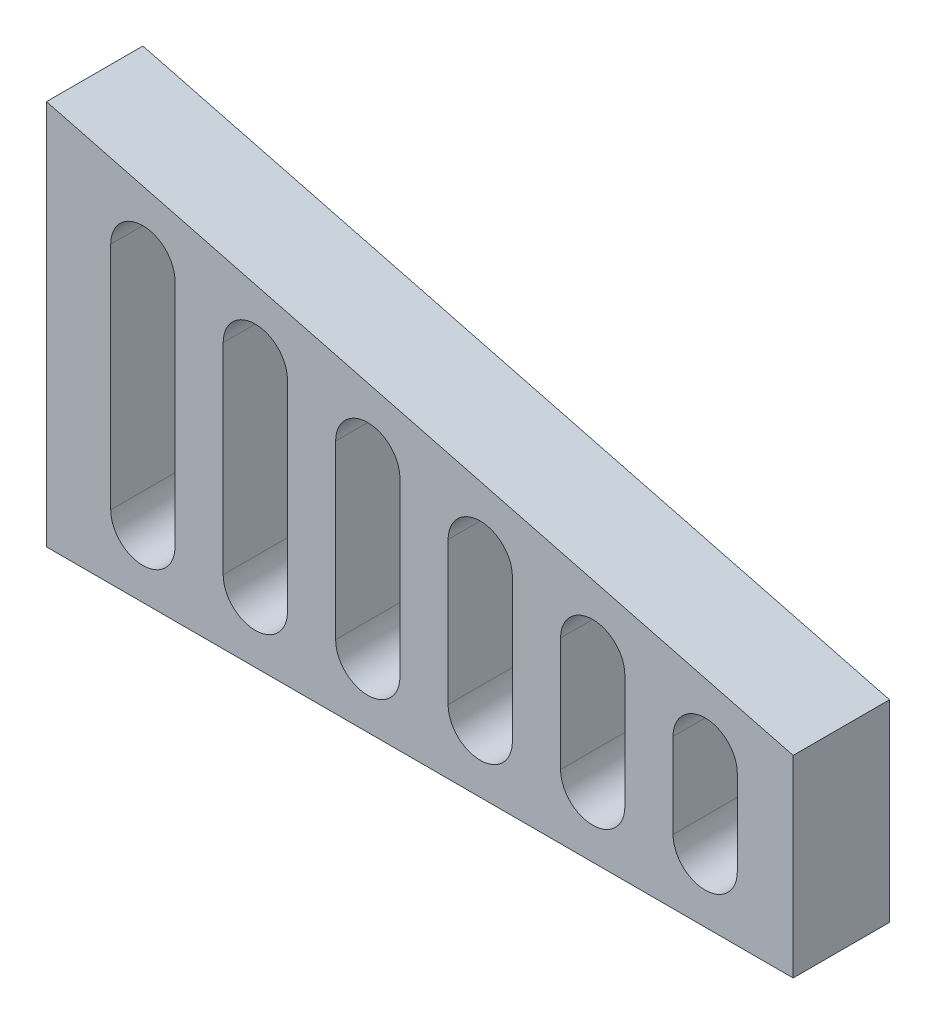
ISO-10303-21;
HEADER;
FILE_DESCRIPTION(('STEP AP214'),'2;1');
FILE_NAME('part.step','',(''),(''),'','','');
FILE_SCHEMA(('AUTOMOTIVE_DESIGN { 1 0 10303 214 1 1 1 1 }'));
ENDSEC;
DATA;
#1=APPLICATION_CONTEXT('core data for automotive mechanical design processes');
#2=APPLICATION_PROTOCOL_DEFINITION('international standard','automotive_design',2000,#1);
#3=PRODUCT_CONTEXT('',#1,'mechanical');
#4=PRODUCT('Part','Part','',(#3));
#5=PRODUCT_RELATED_PRODUCT_CATEGORY('part','',(#4));
#6=PRODUCT_DEFINITION_FORMATION('','',#4);
#7=PRODUCT_DEFINITION_CONTEXT('part definition',#1,'design');
#8=PRODUCT_DEFINITION('design','',#6,#7);
#9=PRODUCT_DEFINITION_SHAPE('','',#8);
#10=(LENGTH_UNIT() NAMED_UNIT(*) SI_UNIT(.MILLI.,.METRE.));
#11=(NAMED_UNIT(*) PLANE_ANGLE_UNIT() SI_UNIT($,.RADIAN.));
#12=(NAMED_UNIT(*) SI_UNIT($,.STERADIAN.) SOLID_ANGLE_UNIT());
#13=UNCERTAINTY_MEASURE_WITH_UNIT(LENGTH_MEASURE(1.E-05),#10,'distance_accuracy_value','');
#14=(GEOMETRIC_REPRESENTATION_CONTEXT(3) GLOBAL_UNCERTAINTY_ASSIGNED_CONTEXT((#13)) GLOBAL_UNIT_ASSIGNED_CONTEXT((#10,
#11,#12)) REPRESENTATION_CONTEXT('',''));
#15=CARTESIAN_POINT('',(0.,0.,0.));
#16=DIRECTION('',(0.,0.,1.));
#17=DIRECTION('',(1.,0.,0.));
#18=AXIS2_PLACEMENT_3D('',#15,#16,#17);
#19=CARTESIAN_POINT('',(0.,38.1,-9.525));
#20=DIRECTION('',(1.,0.,0.));
#21=DIRECTION('',(0.,0.,-1.));
#22=AXIS2_PLACEMENT_3D('',#19,#20,#21);
#23=PLANE('',#22);
#24=DIRECTION('',(0.,1.,0.));
#25=VECTOR('',#24,1.);
#26=CARTESIAN_POINT('',(0.,38.1,0.));
#27=LINE('',#26,#25);
#28=CARTESIAN_POINT('',(0.,0.,0.));
#29=VERTEX_POINT('',#28);
#30=CARTESIAN_POINT('',(0.,38.1,0.));
#31=VERTEX_POINT('',#30);
#32=EDGE_CURVE('E402',#29,#31,#27,.T.);
#33=ORIENTED_EDGE('',*,*,#32,.T.);
#34=DIRECTION('',(0.,0.,1.));
#35=VECTOR('',#34,1.);
#36=CARTESIAN_POINT('',(0.,38.1,-9.525));
#37=LINE('',#36,#35);
#38=CARTESIAN_POINT('',(0.,38.1,-9.525));
#39=VERTEX_POINT('',#38);
#40=EDGE_CURVE('E11',#39,#31,#37,.T.);
#41=ORIENTED_EDGE('',*,*,#40,.F.);
#42=DIRECTION('',(0.,1.,0.));
#43=VECTOR('',#42,1.);
#44=CARTESIAN_POINT('',(0.,38.1,-9.525));
#45=LINE('',#44,#43);
#46=CARTESIAN_POINT('',(0.,0.,-9.525));
#47=VERTEX_POINT('',#46);
#48=EDGE_CURVE('E417',#47,#39,#45,.T.);
#49=ORIENTED_EDGE('',*,*,#48,.F.);
#50=DIRECTION('',(0.,0.,1.));
#51=VECTOR('',#50,1.);
#52=CARTESIAN_POINT('',(0.,0.,-9.525));
#53=LINE('',#52,#51);
#54=EDGE_CURVE('E426',#47,#29,#53,.T.);
#55=ORIENTED_EDGE('',*,*,#54,.T.);
#56=EDGE_LOOP('',(#33,#41,#49,#55));
#57=FACE_BOUND('',#56,.T.);
#58=ADVANCED_FACE('F28',(#57),#23,.F.);
#59=CARTESIAN_POINT('',(0.,38.1,-9.525));
#60=DIRECTION('',(-0.25,-0.968245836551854,0.));
#61=DIRECTION('',(0.968245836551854,-0.25,0.));
#62=AXIS2_PLACEMENT_3D('',#59,#60,#61);
#63=PLANE('',#62);
#64=DIRECTION('',(0.968245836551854,-0.25,0.));
#65=VECTOR('',#64,1.);
#66=CARTESIAN_POINT('',(0.,38.1,0.));
#67=LINE('',#66,#65);
#68=CARTESIAN_POINT('',(73.7803327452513,19.05,0.));
#69=VERTEX_POINT('',#68);
#70=EDGE_CURVE('E411',#31,#69,#67,.T.);
#71=ORIENTED_EDGE('',*,*,#70,.T.);
#72=DIRECTION('',(0.,0.,1.));
#73=VECTOR('',#72,1.);
#74=CARTESIAN_POINT('',(73.7803327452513,19.05,-9.525));
#75=LINE('',#74,#73);
#76=CARTESIAN_POINT('',(73.7803327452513,19.05,-9.525));
#77=VERTEX_POINT('',#76);
#78=EDGE_CURVE('E35',#77,#69,#75,.T.);
#79=ORIENTED_EDGE('',*,*,#78,.F.);
#80=DIRECTION('',(0.968245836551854,-0.25,0.));
#81=VECTOR('',#80,1.);
#82=CARTESIAN_POINT('',(0.,38.1,-9.525));
#83=LINE('',#82,#81);
#84=EDGE_CURVE('E420',#39,#77,#83,.T.);
#85=ORIENTED_EDGE('',*,*,#84,.F.);
#86=ORIENTED_EDGE('',*,*,#40,.T.);
#87=EDGE_LOOP('',(#71,#79,#85,#86));
#88=FACE_BOUND('',#87,.T.);
#89=ADVANCED_FACE('F451',(#88),#63,.F.);
#90=CARTESIAN_POINT('',(73.7803327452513,19.05,-9.525));
#91=DIRECTION('',(-1.,0.,0.));
#92=DIRECTION('',(0.,0.,1.));
#93=AXIS2_PLACEMENT_3D('',#90,#91,#92);
#94=PLANE('',#93);
#95=DIRECTION('',(0.,-1.,0.));
#96=VECTOR('',#95,1.);
#97=CARTESIAN_POINT('',(73.7803327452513,19.05,0.));
#98=LINE('',#97,#96);
#99=CARTESIAN_POINT('',(73.7803327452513,0.,0.));
#100=VERTEX_POINT('',#99);
#101=EDGE_CURVE('E413',#69,#100,#98,.T.);
#102=ORIENTED_EDGE('',*,*,#101,.T.);
#103=DIRECTION('',(0.,0.,1.));
#104=VECTOR('',#103,1.);
#105=CARTESIAN_POINT('',(73.7803327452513,0.,-9.525));
#106=LINE('',#105,#104);
#107=CARTESIAN_POINT('',(73.7803327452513,0.,-9.525));
#108=VERTEX_POINT('',#107);
#109=EDGE_CURVE('E429',#108,#100,#106,.T.);
#110=ORIENTED_EDGE('',*,*,#109,.F.);
#111=DIRECTION('',(0.,-1.,0.));
#112=VECTOR('',#111,1.);
#113=CARTESIAN_POINT('',(73.7803327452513,19.05,-9.525));
#114=LINE('',#113,#112);
#115=EDGE_CURVE('E422',#77,#108,#114,.T.);
#116=ORIENTED_EDGE('',*,*,#115,.F.);
#117=ORIENTED_EDGE('',*,*,#78,.T.);
#118=EDGE_LOOP('',(#102,#110,#116,#117));
#119=FACE_BOUND('',#118,.T.);
#120=ADVANCED_FACE('F436',(#119),#94,.F.);
#121=CARTESIAN_POINT('',(0.,0.,-9.525));
#122=DIRECTION('',(0.,1.,0.));
#123=DIRECTION('',(0.,0.,1.));
#124=AXIS2_PLACEMENT_3D('',#121,#122,#123);
#125=PLANE('',#124);
#126=DIRECTION('',(-1.,0.,0.));
#127=VECTOR('',#126,1.);
#128=CARTESIAN_POINT('',(0.,0.,0.));
#129=LINE('',#128,#127);
#130=EDGE_CURVE('E415',#100,#29,#129,.T.);
#131=ORIENTED_EDGE('',*,*,#130,.T.);
#132=ORIENTED_EDGE('',*,*,#54,.F.);
#133=DIRECTION('',(-1.,0.,0.));
#134=VECTOR('',#133,1.);
#135=CARTESIAN_POINT('',(0.,0.,-9.525));
#136=LINE('',#135,#134);
#137=EDGE_CURVE('E424',#108,#47,#136,.T.);
#138=ORIENTED_EDGE('',*,*,#137,.F.);
#139=ORIENTED_EDGE('',*,*,#109,.T.);
#140=EDGE_LOOP('',(#131,#132,#138,#139));
#141=FACE_BOUND('',#140,.T.);
#142=ADVANCED_FACE('F445',(#141),#125,.F.);
#143=CARTESIAN_POINT('',(0.,0.,-9.525));
#144=DIRECTION('',(0.,0.,1.));
#145=DIRECTION('',(1.,0.,0.));
#146=AXIS2_PLACEMENT_3D('',#143,#144,#145);
#147=PLANE('',#146);
#148=DIRECTION('',(0.,1.,0.));
#149=VECTOR('',#148,1.);
#150=CARTESIAN_POINT('',(61.9125,6.35,-9.525));
#151=LINE('',#150,#149);
#152=CARTESIAN_POINT('',(61.9125,6.35,-9.525));
#153=VERTEX_POINT('',#152);
#154=CARTESIAN_POINT('',(61.9125,14.7362279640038,-9.525));
#155=VERTEX_POINT('',#154);
#156=EDGE_CURVE('E223',#153,#155,#151,.T.);
#157=ORIENTED_EDGE('',*,*,#156,.F.);
#158=CARTESIAN_POINT('',(65.0875,6.35,-9.525));
#159=DIRECTION('',(0.,0.,-1.));
#160=DIRECTION('',(0.,-1.,0.));
#161=AXIS2_PLACEMENT_3D('',#158,#159,#160);
#162=CIRCLE('',#161,3.175);
#163=CARTESIAN_POINT('',(68.2625,6.35,-9.525));
#164=VERTEX_POINT('',#163);
#165=EDGE_CURVE('E42',#164,#153,#162,.T.);
#166=ORIENTED_EDGE('',*,*,#165,.F.);
#167=DIRECTION('',(0.,-1.,0.));
#168=VECTOR('',#167,1.);
#169=CARTESIAN_POINT('',(68.2625,6.35,-9.525));
#170=LINE('',#169,#168);
#171=CARTESIAN_POINT('',(68.2625,14.7362279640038,-9.525));
#172=VERTEX_POINT('',#171);
#173=EDGE_CURVE('E230',#172,#164,#170,.T.);
#174=ORIENTED_EDGE('',*,*,#173,.F.);
#175=CARTESIAN_POINT('',(65.0875,14.7362279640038,-9.525));
#176=DIRECTION('',(0.,0.,-1.));
#177=DIRECTION('',(0.,-1.,0.));
#178=AXIS2_PLACEMENT_3D('',#175,#176,#177);
#179=CIRCLE('',#178,3.175);
#180=EDGE_CURVE('E214',#155,#172,#179,.T.);
#181=ORIENTED_EDGE('',*,*,#180,.F.);
#182=EDGE_LOOP('',(#157,#166,#174,#181));
#183=FACE_BOUND('',#182,.T.);
#184=DIRECTION('',(0.,1.,0.));
#185=VECTOR('',#184,1.);
#186=CARTESIAN_POINT('',(50.8,6.35,-9.525));
#187=LINE('',#186,#185);
#188=CARTESIAN_POINT('',(50.8,6.35,-9.525));
#189=VERTEX_POINT('',#188);
#190=CARTESIAN_POINT('',(50.8,17.6054631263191,-9.525));
#191=VERTEX_POINT('',#190);
#192=EDGE_CURVE('E250',#189,#191,#187,.T.);
#193=ORIENTED_EDGE('',*,*,#192,.F.);
#194=CARTESIAN_POINT('',(53.975,6.35,-9.525));
#195=DIRECTION('',(0.,0.,-1.));
#196=DIRECTION('',(0.,-1.,0.));
#197=AXIS2_PLACEMENT_3D('',#194,#195,#196);
#198=CIRCLE('',#197,3.175);
#199=CARTESIAN_POINT('',(57.15,6.35,-9.525));
#200=VERTEX_POINT('',#199);
#201=EDGE_CURVE('E246',#200,#189,#198,.T.);
#202=ORIENTED_EDGE('',*,*,#201,.F.);
#203=DIRECTION('',(0.,-1.,0.));
#204=VECTOR('',#203,1.);
#205=CARTESIAN_POINT('',(57.15,6.35,-9.525));
#206=LINE('',#205,#204);
#207=CARTESIAN_POINT('',(57.15,17.6054631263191,-9.525));
#208=VERTEX_POINT('',#207);
#209=EDGE_CURVE('E256',#208,#200,#206,.T.);
#210=ORIENTED_EDGE('',*,*,#209,.F.);
#211=CARTESIAN_POINT('',(53.975,17.6054631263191,-9.525));
#212=DIRECTION('',(0.,0.,-1.));
#213=DIRECTION('',(0.,-1.,0.));
#214=AXIS2_PLACEMENT_3D('',#211,#212,#213);
#215=CIRCLE('',#214,3.175);
#216=EDGE_CURVE('E253',#191,#208,#215,.T.);
#217=ORIENTED_EDGE('',*,*,#216,.F.);
#218=EDGE_LOOP('',(#193,#202,#210,#217));
#219=FACE_BOUND('',#218,.T.);
#220=DIRECTION('',(0.,1.,0.));
#221=VECTOR('',#220,1.);
#222=CARTESIAN_POINT('',(39.6875,6.35,-9.525));
#223=LINE('',#222,#221);
#224=CARTESIAN_POINT('',(39.6875,6.35,-9.525));
#225=VERTEX_POINT('',#224);
#226=CARTESIAN_POINT('',(39.6875,20.4746982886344,-9.525));
#227=VERTEX_POINT('',#226);
#228=EDGE_CURVE('E282',#225,#227,#223,.T.);
#229=ORIENTED_EDGE('',*,*,#228,.F.);
#230=CARTESIAN_POINT('',(42.8625,6.35,-9.525));
#231=DIRECTION('',(0.,0.,-1.));
#232=DIRECTION('',(0.,-1.,0.));
#233=AXIS2_PLACEMENT_3D('',#230,#231,#232);
#234=CIRCLE('',#233,3.175);
#235=CARTESIAN_POINT('',(46.0375,6.35,-9.525));
#236=VERTEX_POINT('',#235);
#237=EDGE_CURVE('E274',#236,#225,#234,.T.);
#238=ORIENTED_EDGE('',*,*,#237,.F.);
#239=DIRECTION('',(0.,-1.,0.));
#240=VECTOR('',#239,1.);
#241=CARTESIAN_POINT('',(46.0375,6.35,-9.525));
#242=LINE('',#241,#240);
#243=CARTESIAN_POINT('',(46.0375,20.4746982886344,-9.525));
#244=VERTEX_POINT('',#243);
#245=EDGE_CURVE('E288',#244,#236,#242,.T.);
#246=ORIENTED_EDGE('',*,*,#245,.F.);
#247=CARTESIAN_POINT('',(42.8625,20.4746982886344,-9.525));
#248=DIRECTION('',(0.,0.,-1.));
#249=DIRECTION('',(0.,-1.,0.));
#250=AXIS2_PLACEMENT_3D('',#247,#248,#249);
#251=CIRCLE('',#250,3.175);
#252=EDGE_CURVE('E285',#227,#244,#251,.T.);
#253=ORIENTED_EDGE('',*,*,#252,.F.);
#254=EDGE_LOOP('',(#229,#238,#246,#253));
#255=FACE_BOUND('',#254,.T.);
#256=DIRECTION('',(0.,1.,0.));
#257=VECTOR('',#256,1.);
#258=CARTESIAN_POINT('',(28.575,6.35,-9.525));
#259=LINE('',#258,#257);
#260=CARTESIAN_POINT('',(28.575,6.35,-9.525));
#261=VERTEX_POINT('',#260);
#262=CARTESIAN_POINT('',(28.575,23.3439334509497,-9.525));
#263=VERTEX_POINT('',#262);
#264=EDGE_CURVE('E314',#261,#263,#259,.T.);
#265=ORIENTED_EDGE('',*,*,#264,.F.);
#266=CARTESIAN_POINT('',(31.75,6.35,-9.525));
#267=DIRECTION('',(0.,0.,-1.));
#268=DIRECTION('',(0.,-1.,0.));
#269=AXIS2_PLACEMENT_3D('',#266,#267,#268);
#270=CIRCLE('',#269,3.175);
#271=CARTESIAN_POINT('',(34.925,6.35,-9.525));
#272=VERTEX_POINT('',#271);
#273=EDGE_CURVE('E306',#272,#261,#270,.T.);
#274=ORIENTED_EDGE('',*,*,#273,.F.);
#275=DIRECTION('',(0.,-1.,0.));
#276=VECTOR('',#275,1.);
#277=CARTESIAN_POINT('',(34.925,6.35,-9.525));
#278=LINE('',#277,#276);
#279=CARTESIAN_POINT('',(34.925,23.3439334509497,-9.525));
#280=VERTEX_POINT('',#279);
#281=EDGE_CURVE('E320',#280,#272,#278,.T.);
#282=ORIENTED_EDGE('',*,*,#281,.F.);
#283=CARTESIAN_POINT('',(31.75,23.3439334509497,-9.525));
#284=DIRECTION('',(0.,0.,-1.));
#285=DIRECTION('',(0.,-1.,0.));
#286=AXIS2_PLACEMENT_3D('',#283,#284,#285);
#287=CIRCLE('',#286,3.175);
#288=EDGE_CURVE('E317',#263,#280,#287,.T.);
#289=ORIENTED_EDGE('',*,*,#288,.F.);
#290=EDGE_LOOP('',(#265,#274,#282,#289));
#291=FACE_BOUND('',#290,.T.);
#292=DIRECTION('',(0.,1.,0.));
#293=VECTOR('',#292,1.);
#294=CARTESIAN_POINT('',(17.4625,6.35,-9.525));
#295=LINE('',#294,#293);
#296=CARTESIAN_POINT('',(17.4625,6.34999999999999,-9.525));
#297=VERTEX_POINT('',#296);
#298=CARTESIAN_POINT('',(17.4625,26.2131686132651,-9.525));
#299=VERTEX_POINT('',#298);
#300=EDGE_CURVE('E346',#297,#299,#295,.T.);
#301=ORIENTED_EDGE('',*,*,#300,.F.);
#302=CARTESIAN_POINT('',(20.6375,6.35,-9.525));
#303=DIRECTION('',(0.,0.,-1.));
#304=DIRECTION('',(0.,-1.,0.));
#305=AXIS2_PLACEMENT_3D('',#302,#303,#304);
#306=CIRCLE('',#305,3.175);
#307=CARTESIAN_POINT('',(23.8125,6.35,-9.525));
#308=VERTEX_POINT('',#307);
#309=EDGE_CURVE('E338',#308,#297,#306,.T.);
#310=ORIENTED_EDGE('',*,*,#309,.F.);
#311=DIRECTION('',(0.,-1.,0.));
#312=VECTOR('',#311,1.);
#313=CARTESIAN_POINT('',(23.8125,6.35,-9.525));
#314=LINE('',#313,#312);
#315=CARTESIAN_POINT('',(23.8125,26.2131686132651,-9.525));
#316=VERTEX_POINT('',#315);
#317=EDGE_CURVE('E352',#316,#308,#314,.T.);
#318=ORIENTED_EDGE('',*,*,#317,.F.);
#319=CARTESIAN_POINT('',(20.6375,26.2131686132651,-9.525));
#320=DIRECTION('',(0.,0.,-1.));
#321=DIRECTION('',(0.,-1.,0.));
#322=AXIS2_PLACEMENT_3D('',#319,#320,#321);
#323=CIRCLE('',#322,3.175);
#324=EDGE_CURVE('E349',#299,#316,#323,.T.);
#325=ORIENTED_EDGE('',*,*,#324,.F.);
#326=EDGE_LOOP('',(#301,#310,#318,#325));
#327=FACE_BOUND('',#326,.T.);
#328=DIRECTION('',(0.,1.,0.));
#329=VECTOR('',#328,1.);
#330=CARTESIAN_POINT('',(6.35,6.34999999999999,-9.525));
#331=LINE('',#330,#329);
#332=CARTESIAN_POINT('',(6.35,6.34999999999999,-9.525));
#333=VERTEX_POINT('',#332);
#334=CARTESIAN_POINT('',(6.35,29.0824037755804,-9.525));
#335=VERTEX_POINT('',#334);
#336=EDGE_CURVE('E378',#333,#335,#331,.T.);
#337=ORIENTED_EDGE('',*,*,#336,.F.);
#338=CARTESIAN_POINT('',(9.525,6.35,-9.525));
#339=DIRECTION('',(0.,0.,-1.));
#340=DIRECTION('',(0.,-1.,0.));
#341=AXIS2_PLACEMENT_3D('',#338,#339,#340);
#342=CIRCLE('',#341,3.175);
#343=CARTESIAN_POINT('',(12.7,6.34999999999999,-9.525));
#344=VERTEX_POINT('',#343);
#345=EDGE_CURVE('E370',#344,#333,#342,.T.);
#346=ORIENTED_EDGE('',*,*,#345,.F.);
#347=DIRECTION('',(0.,-1.,0.));
#348=VECTOR('',#347,1.);
#349=CARTESIAN_POINT('',(12.7,6.34999999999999,-9.525));
#350=LINE('',#349,#348);
#351=CARTESIAN_POINT('',(12.7,29.0824037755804,-9.525));
#352=VERTEX_POINT('',#351);
#353=EDGE_CURVE('E384',#352,#344,#350,.T.);
#354=ORIENTED_EDGE('',*,*,#353,.F.);
#355=CARTESIAN_POINT('',(9.525,29.0824037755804,-9.525));
#356=DIRECTION('',(0.,0.,-1.));
#357=DIRECTION('',(0.,-1.,0.));
#358=AXIS2_PLACEMENT_3D('',#355,#356,#357);
#359=CIRCLE('',#358,3.175);
#360=EDGE_CURVE('E381',#335,#352,#359,.T.);
#361=ORIENTED_EDGE('',*,*,#360,.F.);
#362=EDGE_LOOP('',(#337,#346,#354,#361));
#363=FACE_BOUND('',#362,.T.);
#364=ORIENTED_EDGE('',*,*,#48,.T.);
#365=ORIENTED_EDGE('',*,*,#84,.T.);
#366=ORIENTED_EDGE('',*,*,#115,.T.);
#367=ORIENTED_EDGE('',*,*,#137,.T.);
#368=EDGE_LOOP('',(#364,#365,#366,#367));
#369=FACE_BOUND('',#368,.T.);
#370=ADVANCED_FACE('F227',(#183,#219,#255,#291,#327,#363,#369),#147,.F.);
#371=CARTESIAN_POINT('',(0.,0.,0.));
#372=DIRECTION('',(0.,0.,1.));
#373=DIRECTION('',(1.,0.,0.));
#374=AXIS2_PLACEMENT_3D('',#371,#372,#373);
#375=PLANE('',#374);
#376=CARTESIAN_POINT('',(65.0875,6.35,0.));
#377=DIRECTION('',(0.,0.,-1.));
#378=DIRECTION('',(0.,-1.,0.));
#379=AXIS2_PLACEMENT_3D('',#376,#377,#378);
#380=CIRCLE('',#379,3.175);
#381=CARTESIAN_POINT('',(68.2625,6.35,0.));
#382=VERTEX_POINT('',#381);
#383=CARTESIAN_POINT('',(61.9125,6.35,0.));
#384=VERTEX_POINT('',#383);
#385=EDGE_CURVE('E232',#382,#384,#380,.T.);
#386=ORIENTED_EDGE('',*,*,#385,.T.);
#387=DIRECTION('',(0.,1.,0.));
#388=VECTOR('',#387,1.);
#389=CARTESIAN_POINT('',(61.9125,6.35,0.));
#390=LINE('',#389,#388);
#391=CARTESIAN_POINT('',(61.9125,14.7362279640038,0.));
#392=VERTEX_POINT('',#391);
#393=EDGE_CURVE('E238',#384,#392,#390,.T.);
#394=ORIENTED_EDGE('',*,*,#393,.T.);
#395=CARTESIAN_POINT('',(65.0875,14.7362279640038,0.));
#396=DIRECTION('',(0.,0.,-1.));
#397=DIRECTION('',(0.,-1.,0.));
#398=AXIS2_PLACEMENT_3D('',#395,#396,#397);
#399=CIRCLE('',#398,3.175);
#400=CARTESIAN_POINT('',(68.2625,14.7362279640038,0.));
#401=VERTEX_POINT('',#400);
#402=EDGE_CURVE('E50',#392,#401,#399,.T.);
#403=ORIENTED_EDGE('',*,*,#402,.T.);
#404=DIRECTION('',(0.,-1.,0.));
#405=VECTOR('',#404,1.);
#406=CARTESIAN_POINT('',(68.2625,6.35,0.));
#407=LINE('',#406,#405);
#408=EDGE_CURVE('E241',#401,#382,#407,.T.);
#409=ORIENTED_EDGE('',*,*,#408,.T.);
#410=EDGE_LOOP('',(#386,#394,#403,#409));
#411=FACE_BOUND('',#410,.T.);
#412=CARTESIAN_POINT('',(53.975,6.35,0.));
#413=DIRECTION('',(0.,0.,-1.));
#414=DIRECTION('',(0.,-1.,0.));
#415=AXIS2_PLACEMENT_3D('',#412,#413,#414);
#416=CIRCLE('',#415,3.175);
#417=CARTESIAN_POINT('',(57.15,6.35,0.));
#418=VERTEX_POINT('',#417);
#419=CARTESIAN_POINT('',(50.8,6.35,0.));
#420=VERTEX_POINT('',#419);
#421=EDGE_CURVE('E259',#418,#420,#416,.T.);
#422=ORIENTED_EDGE('',*,*,#421,.T.);
#423=DIRECTION('',(0.,1.,0.));
#424=VECTOR('',#423,1.);
#425=CARTESIAN_POINT('',(50.8,6.35,0.));
#426=LINE('',#425,#424);
#427=CARTESIAN_POINT('',(50.8,17.6054631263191,0.));
#428=VERTEX_POINT('',#427);
#429=EDGE_CURVE('E262',#420,#428,#426,.T.);
#430=ORIENTED_EDGE('',*,*,#429,.T.);
#431=CARTESIAN_POINT('',(53.975,17.6054631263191,0.));
#432=DIRECTION('',(0.,0.,-1.));
#433=DIRECTION('',(0.,-1.,0.));
#434=AXIS2_PLACEMENT_3D('',#431,#432,#433);
#435=CIRCLE('',#434,3.175);
#436=CARTESIAN_POINT('',(57.15,17.6054631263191,0.));
#437=VERTEX_POINT('',#436);
#438=EDGE_CURVE('E265',#428,#437,#435,.T.);
#439=ORIENTED_EDGE('',*,*,#438,.T.);
#440=DIRECTION('',(0.,-1.,0.));
#441=VECTOR('',#440,1.);
#442=CARTESIAN_POINT('',(57.15,6.35,0.));
#443=LINE('',#442,#441);
#444=EDGE_CURVE('E268',#437,#418,#443,.T.);
#445=ORIENTED_EDGE('',*,*,#444,.T.);
#446=EDGE_LOOP('',(#422,#430,#439,#445));
#447=FACE_BOUND('',#446,.T.);
#448=CARTESIAN_POINT('',(42.8625,6.35,0.));
#449=DIRECTION('',(0.,0.,-1.));
#450=DIRECTION('',(0.,-1.,0.));
#451=AXIS2_PLACEMENT_3D('',#448,#449,#450);
#452=CIRCLE('',#451,3.175);
#453=CARTESIAN_POINT('',(46.0375,6.35,0.));
#454=VERTEX_POINT('',#453);
#455=CARTESIAN_POINT('',(39.6875,6.35,0.));
#456=VERTEX_POINT('',#455);
#457=EDGE_CURVE('E291',#454,#456,#452,.T.);
#458=ORIENTED_EDGE('',*,*,#457,.T.);
#459=DIRECTION('',(0.,1.,0.));
#460=VECTOR('',#459,1.);
#461=CARTESIAN_POINT('',(39.6875,6.35,0.));
#462=LINE('',#461,#460);
#463=CARTESIAN_POINT('',(39.6875,20.4746982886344,0.));
#464=VERTEX_POINT('',#463);
#465=EDGE_CURVE('E294',#456,#464,#462,.T.);
#466=ORIENTED_EDGE('',*,*,#465,.T.);
#467=CARTESIAN_POINT('',(42.8625,20.4746982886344,0.));
#468=DIRECTION('',(0.,0.,-1.));
#469=DIRECTION('',(0.,-1.,0.));
#470=AXIS2_PLACEMENT_3D('',#467,#468,#469);
#471=CIRCLE('',#470,3.175);
#472=CARTESIAN_POINT('',(46.0375,20.4746982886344,0.));
#473=VERTEX_POINT('',#472);
#474=EDGE_CURVE('E297',#464,#473,#471,.T.);
#475=ORIENTED_EDGE('',*,*,#474,.T.);
#476=DIRECTION('',(0.,-1.,0.));
#477=VECTOR('',#476,1.);
#478=CARTESIAN_POINT('',(46.0375,6.35,0.));
#479=LINE('',#478,#477);
#480=EDGE_CURVE('E300',#473,#454,#479,.T.);
#481=ORIENTED_EDGE('',*,*,#480,.T.);
#482=EDGE_LOOP('',(#458,#466,#475,#481));
#483=FACE_BOUND('',#482,.T.);
#484=CARTESIAN_POINT('',(31.75,6.35,0.));
#485=DIRECTION('',(0.,0.,-1.));
#486=DIRECTION('',(0.,-1.,0.));
#487=AXIS2_PLACEMENT_3D('',#484,#485,#486);
#488=CIRCLE('',#487,3.175);
#489=CARTESIAN_POINT('',(34.925,6.35,0.));
#490=VERTEX_POINT('',#489);
#491=CARTESIAN_POINT('',(28.575,6.35,0.));
#492=VERTEX_POINT('',#491);
#493=EDGE_CURVE('E323',#490,#492,#488,.T.);
#494=ORIENTED_EDGE('',*,*,#493,.T.);
#495=DIRECTION('',(0.,1.,0.));
#496=VECTOR('',#495,1.);
#497=CARTESIAN_POINT('',(28.575,6.35,0.));
#498=LINE('',#497,#496);
#499=CARTESIAN_POINT('',(28.575,23.3439334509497,0.));
#500=VERTEX_POINT('',#499);
#501=EDGE_CURVE('E326',#492,#500,#498,.T.);
#502=ORIENTED_EDGE('',*,*,#501,.T.);
#503=CARTESIAN_POINT('',(31.75,23.3439334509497,0.));
#504=DIRECTION('',(0.,0.,-1.));
#505=DIRECTION('',(0.,-1.,0.));
#506=AXIS2_PLACEMENT_3D('',#503,#504,#505);
#507=CIRCLE('',#506,3.175);
#508=CARTESIAN_POINT('',(34.925,23.3439334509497,0.));
#509=VERTEX_POINT('',#508);
#510=EDGE_CURVE('E329',#500,#509,#507,.T.);
#511=ORIENTED_EDGE('',*,*,#510,.T.);
#512=DIRECTION('',(0.,-1.,0.));
#513=VECTOR('',#512,1.);
#514=CARTESIAN_POINT('',(34.925,6.35,0.));
#515=LINE('',#514,#513);
#516=EDGE_CURVE('E332',#509,#490,#515,.T.);
#517=ORIENTED_EDGE('',*,*,#516,.T.);
#518=EDGE_LOOP('',(#494,#502,#511,#517));
#519=FACE_BOUND('',#518,.T.);
#520=CARTESIAN_POINT('',(20.6375,6.35,0.));
#521=DIRECTION('',(0.,0.,-1.));
#522=DIRECTION('',(0.,-1.,0.));
#523=AXIS2_PLACEMENT_3D('',#520,#521,#522);
#524=CIRCLE('',#523,3.175);
#525=CARTESIAN_POINT('',(23.8125,6.35,0.));
#526=VERTEX_POINT('',#525);
#527=CARTESIAN_POINT('',(17.4625,6.35,0.));
#528=VERTEX_POINT('',#527);
#529=EDGE_CURVE('E355',#526,#528,#524,.T.);
#530=ORIENTED_EDGE('',*,*,#529,.T.);
#531=DIRECTION('',(0.,1.,0.));
#532=VECTOR('',#531,1.);
#533=CARTESIAN_POINT('',(17.4625,6.35,0.));
#534=LINE('',#533,#532);
#535=CARTESIAN_POINT('',(17.4625,26.2131686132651,0.));
#536=VERTEX_POINT('',#535);
#537=EDGE_CURVE('E358',#528,#536,#534,.T.);
#538=ORIENTED_EDGE('',*,*,#537,.T.);
#539=CARTESIAN_POINT('',(20.6375,26.2131686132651,0.));
#540=DIRECTION('',(0.,0.,-1.));
#541=DIRECTION('',(0.,-1.,0.));
#542=AXIS2_PLACEMENT_3D('',#539,#540,#541);
#543=CIRCLE('',#542,3.175);
#544=CARTESIAN_POINT('',(23.8125,26.2131686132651,0.));
#545=VERTEX_POINT('',#544);
#546=EDGE_CURVE('E361',#536,#545,#543,.T.);
#547=ORIENTED_EDGE('',*,*,#546,.T.);
#548=DIRECTION('',(0.,-1.,0.));
#549=VECTOR('',#548,1.);
#550=CARTESIAN_POINT('',(23.8125,6.35,0.));
#551=LINE('',#550,#549);
#552=EDGE_CURVE('E364',#545,#526,#551,.T.);
#553=ORIENTED_EDGE('',*,*,#552,.T.);
#554=EDGE_LOOP('',(#530,#538,#547,#553));
#555=FACE_BOUND('',#554,.T.);
#556=CARTESIAN_POINT('',(9.525,6.35,0.));
#557=DIRECTION('',(0.,0.,-1.));
#558=DIRECTION('',(0.,-1.,0.));
#559=AXIS2_PLACEMENT_3D('',#556,#557,#558);
#560=CIRCLE('',#559,3.175);
#561=CARTESIAN_POINT('',(12.7,6.35,0.));
#562=VERTEX_POINT('',#561);
#563=CARTESIAN_POINT('',(6.35,6.35,0.));
#564=VERTEX_POINT('',#563);
#565=EDGE_CURVE('E387',#562,#564,#560,.T.);
#566=ORIENTED_EDGE('',*,*,#565,.T.);
#567=DIRECTION('',(0.,1.,0.));
#568=VECTOR('',#567,1.);
#569=CARTESIAN_POINT('',(6.35,6.35,0.));
#570=LINE('',#569,#568);
#571=CARTESIAN_POINT('',(6.35,29.0824037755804,0.));
#572=VERTEX_POINT('',#571);
#573=EDGE_CURVE('E390',#564,#572,#570,.T.);
#574=ORIENTED_EDGE('',*,*,#573,.T.);
#575=CARTESIAN_POINT('',(9.525,29.0824037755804,0.));
#576=DIRECTION('',(0.,0.,-1.));
#577=DIRECTION('',(0.,-1.,0.));
#578=AXIS2_PLACEMENT_3D('',#575,#576,#577);
#579=CIRCLE('',#578,3.175);
#580=CARTESIAN_POINT('',(12.7,29.0824037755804,0.));
#581=VERTEX_POINT('',#580);
#582=EDGE_CURVE('E393',#572,#581,#579,.T.);
#583=ORIENTED_EDGE('',*,*,#582,.T.);
#584=DIRECTION('',(0.,-1.,0.));
#585=VECTOR('',#584,1.);
#586=CARTESIAN_POINT('',(12.7,6.35,0.));
#587=LINE('',#586,#585);
#588=EDGE_CURVE('E396',#581,#562,#587,.T.);
#589=ORIENTED_EDGE('',*,*,#588,.T.);
#590=EDGE_LOOP('',(#566,#574,#583,#589));
#591=FACE_BOUND('',#590,.T.);
#592=ORIENTED_EDGE('',*,*,#32,.F.);
#593=ORIENTED_EDGE('',*,*,#130,.F.);
#594=ORIENTED_EDGE('',*,*,#101,.F.);
#595=ORIENTED_EDGE('',*,*,#70,.F.);
#596=EDGE_LOOP('',(#592,#593,#594,#595));
#597=FACE_BOUND('',#596,.T.);
#598=ADVANCED_FACE('F442',(#411,#447,#483,#519,#555,#591,#597),#375,.T.);
#599=CARTESIAN_POINT('',(9.525,6.35,0.));
#600=DIRECTION('',(0.,0.,-1.));
#601=DIRECTION('',(0.,1.,0.));
#602=AXIS2_PLACEMENT_3D('',#599,#600,#601);
#603=CYLINDRICAL_SURFACE('',#602,3.175);
#604=ORIENTED_EDGE('',*,*,#345,.T.);
#605=DIRECTION('',(0.,0.,-1.));
#606=VECTOR('',#605,1.);
#607=CARTESIAN_POINT('',(6.35,6.35,0.));
#608=LINE('',#607,#606);
#609=EDGE_CURVE('E399',#564,#333,#608,.T.);
#610=ORIENTED_EDGE('',*,*,#609,.F.);
#611=ORIENTED_EDGE('',*,*,#565,.F.);
#612=DIRECTION('',(0.,0.,-1.));
#613=VECTOR('',#612,1.);
#614=CARTESIAN_POINT('',(12.7,6.35,0.));
#615=LINE('',#614,#613);
#616=EDGE_CURVE('E400',#562,#344,#615,.T.);
#617=ORIENTED_EDGE('',*,*,#616,.T.);
#618=EDGE_LOOP('',(#604,#610,#611,#617));
#619=FACE_BOUND('',#618,.T.);
#620=ADVANCED_FACE('F465',(#619),#603,.F.);
#621=CARTESIAN_POINT('',(12.7,6.35,0.));
#622=DIRECTION('',(1.,0.,0.));
#623=DIRECTION('',(0.,1.,0.));
#624=AXIS2_PLACEMENT_3D('',#621,#622,#623);
#625=PLANE('',#624);
#626=ORIENTED_EDGE('',*,*,#353,.T.);
#627=ORIENTED_EDGE('',*,*,#616,.F.);
#628=ORIENTED_EDGE('',*,*,#588,.F.);
#629=DIRECTION('',(0.,0.,-1.));
#630=VECTOR('',#629,1.);
#631=CARTESIAN_POINT('',(12.7,29.0824037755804,0.));
#632=LINE('',#631,#630);
#633=EDGE_CURVE('E403',#581,#352,#632,.T.);
#634=ORIENTED_EDGE('',*,*,#633,.T.);
#635=EDGE_LOOP('',(#626,#627,#628,#634));
#636=FACE_BOUND('',#635,.T.);
#637=ADVANCED_FACE('F469',(#636),#625,.F.);
#638=CARTESIAN_POINT('',(9.525,29.0824037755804,0.));
#639=DIRECTION('',(0.,0.,-1.));
#640=DIRECTION('',(0.,1.,0.));
#641=AXIS2_PLACEMENT_3D('',#638,#639,#640);
#642=CYLINDRICAL_SURFACE('',#641,3.175);
#643=ORIENTED_EDGE('',*,*,#360,.T.);
#644=ORIENTED_EDGE('',*,*,#633,.F.);
#645=ORIENTED_EDGE('',*,*,#582,.F.);
#646=DIRECTION('',(0.,0.,-1.));
#647=VECTOR('',#646,1.);
#648=CARTESIAN_POINT('',(6.35,29.0824037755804,0.));
#649=LINE('',#648,#647);
#650=EDGE_CURVE('E405',#572,#335,#649,.T.);
#651=ORIENTED_EDGE('',*,*,#650,.T.);
#652=EDGE_LOOP('',(#643,#644,#645,#651));
#653=FACE_BOUND('',#652,.T.);
#654=ADVANCED_FACE('F475',(#653),#642,.F.);
#655=CARTESIAN_POINT('',(6.35,6.35,0.));
#656=DIRECTION('',(-1.,0.,0.));
#657=DIRECTION('',(0.,-1.,0.));
#658=AXIS2_PLACEMENT_3D('',#655,#656,#657);
#659=PLANE('',#658);
#660=ORIENTED_EDGE('',*,*,#336,.T.);
#661=ORIENTED_EDGE('',*,*,#650,.F.);
#662=ORIENTED_EDGE('',*,*,#573,.F.);
#663=ORIENTED_EDGE('',*,*,#609,.T.);
#664=EDGE_LOOP('',(#660,#661,#662,#663));
#665=FACE_BOUND('',#664,.T.);
#666=ADVANCED_FACE('F471',(#665),#659,.F.);
#667=CARTESIAN_POINT('',(20.6375,6.35,0.));
#668=DIRECTION('',(0.,0.,-1.));
#669=DIRECTION('',(0.,1.,0.));
#670=AXIS2_PLACEMENT_3D('',#667,#668,#669);
#671=CYLINDRICAL_SURFACE('',#670,3.175);
#672=ORIENTED_EDGE('',*,*,#309,.T.);
#673=DIRECTION('',(0.,0.,-1.));
#674=VECTOR('',#673,1.);
#675=CARTESIAN_POINT('',(17.4625,6.35,0.));
#676=LINE('',#675,#674);
#677=EDGE_CURVE('E367',#528,#297,#676,.T.);
#678=ORIENTED_EDGE('',*,*,#677,.F.);
#679=ORIENTED_EDGE('',*,*,#529,.F.);
#680=DIRECTION('',(0.,0.,-1.));
#681=VECTOR('',#680,1.);
#682=CARTESIAN_POINT('',(23.8125,6.35,0.));
#683=LINE('',#682,#681);
#684=EDGE_CURVE('E368',#526,#308,#683,.T.);
#685=ORIENTED_EDGE('',*,*,#684,.T.);
#686=EDGE_LOOP('',(#672,#678,#679,#685));
#687=FACE_BOUND('',#686,.T.);
#688=ADVANCED_FACE('F474',(#687),#671,.F.);
#689=CARTESIAN_POINT('',(23.8125,6.35,0.));
#690=DIRECTION('',(1.,0.,0.));
#691=DIRECTION('',(0.,0.,-1.));
#692=AXIS2_PLACEMENT_3D('',#689,#690,#691);
#693=PLANE('',#692);
#694=ORIENTED_EDGE('',*,*,#317,.T.);
#695=ORIENTED_EDGE('',*,*,#684,.F.);
#696=ORIENTED_EDGE('',*,*,#552,.F.);
#697=DIRECTION('',(0.,0.,-1.));
#698=VECTOR('',#697,1.);
#699=CARTESIAN_POINT('',(23.8125,26.2131686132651,0.));
#700=LINE('',#699,#698);
#701=EDGE_CURVE('E371',#545,#316,#700,.T.);
#702=ORIENTED_EDGE('',*,*,#701,.T.);
#703=EDGE_LOOP('',(#694,#695,#696,#702));
#704=FACE_BOUND('',#703,.T.);
#705=ADVANCED_FACE('F485',(#704),#693,.F.);
#706=CARTESIAN_POINT('',(20.6375,26.2131686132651,0.));
#707=DIRECTION('',(0.,0.,-1.));
#708=DIRECTION('',(0.,1.,0.));
#709=AXIS2_PLACEMENT_3D('',#706,#707,#708);
#710=CYLINDRICAL_SURFACE('',#709,3.175);
#711=ORIENTED_EDGE('',*,*,#324,.T.);
#712=ORIENTED_EDGE('',*,*,#701,.F.);
#713=ORIENTED_EDGE('',*,*,#546,.F.);
#714=DIRECTION('',(0.,0.,-1.));
#715=VECTOR('',#714,1.);
#716=CARTESIAN_POINT('',(17.4625,26.2131686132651,0.));
#717=LINE('',#716,#715);
#718=EDGE_CURVE('E373',#536,#299,#717,.T.);
#719=ORIENTED_EDGE('',*,*,#718,.T.);
#720=EDGE_LOOP('',(#711,#712,#713,#719));
#721=FACE_BOUND('',#720,.T.);
#722=ADVANCED_FACE('F491',(#721),#710,.F.);
#723=CARTESIAN_POINT('',(17.4625,6.35,0.));
#724=DIRECTION('',(-1.,0.,0.));
#725=DIRECTION('',(0.,-1.,0.));
#726=AXIS2_PLACEMENT_3D('',#723,#724,#725);
#727=PLANE('',#726);
#728=ORIENTED_EDGE('',*,*,#300,.T.);
#729=ORIENTED_EDGE('',*,*,#718,.F.);
#730=ORIENTED_EDGE('',*,*,#537,.F.);
#731=ORIENTED_EDGE('',*,*,#677,.T.);
#732=EDGE_LOOP('',(#728,#729,#730,#731));
#733=FACE_BOUND('',#732,.T.);
#734=ADVANCED_FACE('F487',(#733),#727,.F.);
#735=CARTESIAN_POINT('',(31.75,6.35,0.));
#736=DIRECTION('',(0.,0.,-1.));
#737=DIRECTION('',(0.,1.,0.));
#738=AXIS2_PLACEMENT_3D('',#735,#736,#737);
#739=CYLINDRICAL_SURFACE('',#738,3.175);
#740=ORIENTED_EDGE('',*,*,#273,.T.);
#741=DIRECTION('',(0.,0.,-1.));
#742=VECTOR('',#741,1.);
#743=CARTESIAN_POINT('',(28.575,6.35,0.));
#744=LINE('',#743,#742);
#745=EDGE_CURVE('E335',#492,#261,#744,.T.);
#746=ORIENTED_EDGE('',*,*,#745,.F.);
#747=ORIENTED_EDGE('',*,*,#493,.F.);
#748=DIRECTION('',(0.,0.,-1.));
#749=VECTOR('',#748,1.);
#750=CARTESIAN_POINT('',(34.925,6.35,0.));
#751=LINE('',#750,#749);
#752=EDGE_CURVE('E336',#490,#272,#751,.T.);
#753=ORIENTED_EDGE('',*,*,#752,.T.);
#754=EDGE_LOOP('',(#740,#746,#747,#753));
#755=FACE_BOUND('',#754,.T.);
#756=ADVANCED_FACE('F490',(#755),#739,.F.);
#757=CARTESIAN_POINT('',(34.925,6.35,0.));
#758=DIRECTION('',(1.,0.,0.));
#759=DIRECTION('',(0.,0.,-1.));
#760=AXIS2_PLACEMENT_3D('',#757,#758,#759);
#761=PLANE('',#760);
#762=ORIENTED_EDGE('',*,*,#281,.T.);
#763=ORIENTED_EDGE('',*,*,#752,.F.);
#764=ORIENTED_EDGE('',*,*,#516,.F.);
#765=DIRECTION('',(0.,0.,-1.));
#766=VECTOR('',#765,1.);
#767=CARTESIAN_POINT('',(34.925,23.3439334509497,0.));
#768=LINE('',#767,#766);
#769=EDGE_CURVE('E339',#509,#280,#768,.T.);
#770=ORIENTED_EDGE('',*,*,#769,.T.);
#771=EDGE_LOOP('',(#762,#763,#764,#770));
#772=FACE_BOUND('',#771,.T.);
#773=ADVANCED_FACE('F501',(#772),#761,.F.);
#774=CARTESIAN_POINT('',(31.75,23.3439334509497,0.));
#775=DIRECTION('',(0.,0.,-1.));
#776=DIRECTION('',(0.,1.,0.));
#777=AXIS2_PLACEMENT_3D('',#774,#775,#776);
#778=CYLINDRICAL_SURFACE('',#777,3.175);
#779=ORIENTED_EDGE('',*,*,#288,.T.);
#780=ORIENTED_EDGE('',*,*,#769,.F.);
#781=ORIENTED_EDGE('',*,*,#510,.F.);
#782=DIRECTION('',(0.,0.,-1.));
#783=VECTOR('',#782,1.);
#784=CARTESIAN_POINT('',(28.575,23.3439334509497,0.));
#785=LINE('',#784,#783);
#786=EDGE_CURVE('E341',#500,#263,#785,.T.);
#787=ORIENTED_EDGE('',*,*,#786,.T.);
#788=EDGE_LOOP('',(#779,#780,#781,#787));
#789=FACE_BOUND('',#788,.T.);
#790=ADVANCED_FACE('F507',(#789),#778,.F.);
#791=CARTESIAN_POINT('',(28.575,6.35,0.));
#792=DIRECTION('',(-1.,0.,0.));
#793=DIRECTION('',(0.,0.,1.));
#794=AXIS2_PLACEMENT_3D('',#791,#792,#793);
#795=PLANE('',#794);
#796=ORIENTED_EDGE('',*,*,#264,.T.);
#797=ORIENTED_EDGE('',*,*,#786,.F.);
#798=ORIENTED_EDGE('',*,*,#501,.F.);
#799=ORIENTED_EDGE('',*,*,#745,.T.);
#800=EDGE_LOOP('',(#796,#797,#798,#799));
#801=FACE_BOUND('',#800,.T.);
#802=ADVANCED_FACE('F503',(#801),#795,.F.);
#803=CARTESIAN_POINT('',(42.8625,6.35,0.));
#804=DIRECTION('',(0.,0.,-1.));
#805=DIRECTION('',(0.,1.,0.));
#806=AXIS2_PLACEMENT_3D('',#803,#804,#805);
#807=CYLINDRICAL_SURFACE('',#806,3.175);
#808=ORIENTED_EDGE('',*,*,#237,.T.);
#809=DIRECTION('',(0.,0.,-1.));
#810=VECTOR('',#809,1.);
#811=CARTESIAN_POINT('',(39.6875,6.35,0.));
#812=LINE('',#811,#810);
#813=EDGE_CURVE('E303',#456,#225,#812,.T.);
#814=ORIENTED_EDGE('',*,*,#813,.F.);
#815=ORIENTED_EDGE('',*,*,#457,.F.);
#816=DIRECTION('',(0.,0.,-1.));
#817=VECTOR('',#816,1.);
#818=CARTESIAN_POINT('',(46.0375,6.35,0.));
#819=LINE('',#818,#817);
#820=EDGE_CURVE('E304',#454,#236,#819,.T.);
#821=ORIENTED_EDGE('',*,*,#820,.T.);
#822=EDGE_LOOP('',(#808,#814,#815,#821));
#823=FACE_BOUND('',#822,.T.);
#824=ADVANCED_FACE('F506',(#823),#807,.F.);
#825=CARTESIAN_POINT('',(46.0375,6.35,0.));
#826=DIRECTION('',(1.,0.,0.));
#827=DIRECTION('',(0.,0.,-1.));
#828=AXIS2_PLACEMENT_3D('',#825,#826,#827);
#829=PLANE('',#828);
#830=ORIENTED_EDGE('',*,*,#245,.T.);
#831=ORIENTED_EDGE('',*,*,#820,.F.);
#832=ORIENTED_EDGE('',*,*,#480,.F.);
#833=DIRECTION('',(0.,0.,-1.));
#834=VECTOR('',#833,1.);
#835=CARTESIAN_POINT('',(46.0375,20.4746982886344,0.));
#836=LINE('',#835,#834);
#837=EDGE_CURVE('E307',#473,#244,#836,.T.);
#838=ORIENTED_EDGE('',*,*,#837,.T.);
#839=EDGE_LOOP('',(#830,#831,#832,#838));
#840=FACE_BOUND('',#839,.T.);
#841=ADVANCED_FACE('F517',(#840),#829,.F.);
#842=CARTESIAN_POINT('',(42.8625,20.4746982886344,0.));
#843=DIRECTION('',(0.,0.,-1.));
#844=DIRECTION('',(0.,1.,0.));
#845=AXIS2_PLACEMENT_3D('',#842,#843,#844);
#846=CYLINDRICAL_SURFACE('',#845,3.175);
#847=ORIENTED_EDGE('',*,*,#252,.T.);
#848=ORIENTED_EDGE('',*,*,#837,.F.);
#849=ORIENTED_EDGE('',*,*,#474,.F.);
#850=DIRECTION('',(0.,0.,-1.));
#851=VECTOR('',#850,1.);
#852=CARTESIAN_POINT('',(39.6875,20.4746982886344,0.));
#853=LINE('',#852,#851);
#854=EDGE_CURVE('E309',#464,#227,#853,.T.);
#855=ORIENTED_EDGE('',*,*,#854,.T.);
#856=EDGE_LOOP('',(#847,#848,#849,#855));
#857=FACE_BOUND('',#856,.T.);
#858=ADVANCED_FACE('F523',(#857),#846,.F.);
#859=CARTESIAN_POINT('',(39.6875,6.35,0.));
#860=DIRECTION('',(-1.,0.,0.));
#861=DIRECTION('',(0.,0.,1.));
#862=AXIS2_PLACEMENT_3D('',#859,#860,#861);
#863=PLANE('',#862);
#864=ORIENTED_EDGE('',*,*,#228,.T.);
#865=ORIENTED_EDGE('',*,*,#854,.F.);
#866=ORIENTED_EDGE('',*,*,#465,.F.);
#867=ORIENTED_EDGE('',*,*,#813,.T.);
#868=EDGE_LOOP('',(#864,#865,#866,#867));
#869=FACE_BOUND('',#868,.T.);
#870=ADVANCED_FACE('F519',(#869),#863,.F.);
#871=CARTESIAN_POINT('',(53.975,6.35,0.));
#872=DIRECTION('',(0.,0.,-1.));
#873=DIRECTION('',(0.,1.,0.));
#874=AXIS2_PLACEMENT_3D('',#871,#872,#873);
#875=CYLINDRICAL_SURFACE('',#874,3.175);
#876=ORIENTED_EDGE('',*,*,#201,.T.);
#877=DIRECTION('',(0.,0.,-1.));
#878=VECTOR('',#877,1.);
#879=CARTESIAN_POINT('',(50.8,6.35,0.));
#880=LINE('',#879,#878);
#881=EDGE_CURVE('E271',#420,#189,#880,.T.);
#882=ORIENTED_EDGE('',*,*,#881,.F.);
#883=ORIENTED_EDGE('',*,*,#421,.F.);
#884=DIRECTION('',(0.,0.,-1.));
#885=VECTOR('',#884,1.);
#886=CARTESIAN_POINT('',(57.15,6.35,0.));
#887=LINE('',#886,#885);
#888=EDGE_CURVE('E272',#418,#200,#887,.T.);
#889=ORIENTED_EDGE('',*,*,#888,.T.);
#890=EDGE_LOOP('',(#876,#882,#883,#889));
#891=FACE_BOUND('',#890,.T.);
#892=ADVANCED_FACE('F522',(#891),#875,.F.);
#893=CARTESIAN_POINT('',(57.15,6.35,0.));
#894=DIRECTION('',(1.,0.,0.));
#895=DIRECTION('',(0.,0.,-1.));
#896=AXIS2_PLACEMENT_3D('',#893,#894,#895);
#897=PLANE('',#896);
#898=ORIENTED_EDGE('',*,*,#209,.T.);
#899=ORIENTED_EDGE('',*,*,#888,.F.);
#900=ORIENTED_EDGE('',*,*,#444,.F.);
#901=DIRECTION('',(0.,0.,-1.));
#902=VECTOR('',#901,1.);
#903=CARTESIAN_POINT('',(57.15,17.6054631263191,0.));
#904=LINE('',#903,#902);
#905=EDGE_CURVE('E275',#437,#208,#904,.T.);
#906=ORIENTED_EDGE('',*,*,#905,.T.);
#907=EDGE_LOOP('',(#898,#899,#900,#906));
#908=FACE_BOUND('',#907,.T.);
#909=ADVANCED_FACE('F533',(#908),#897,.F.);
#910=CARTESIAN_POINT('',(53.975,17.6054631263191,0.));
#911=DIRECTION('',(0.,0.,-1.));
#912=DIRECTION('',(0.,1.,0.));
#913=AXIS2_PLACEMENT_3D('',#910,#911,#912);
#914=CYLINDRICAL_SURFACE('',#913,3.175);
#915=ORIENTED_EDGE('',*,*,#216,.T.);
#916=ORIENTED_EDGE('',*,*,#905,.F.);
#917=ORIENTED_EDGE('',*,*,#438,.F.);
#918=DIRECTION('',(0.,0.,-1.));
#919=VECTOR('',#918,1.);
#920=CARTESIAN_POINT('',(50.8,17.6054631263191,0.));
#921=LINE('',#920,#919);
#922=EDGE_CURVE('E277',#428,#191,#921,.T.);
#923=ORIENTED_EDGE('',*,*,#922,.T.);
#924=EDGE_LOOP('',(#915,#916,#917,#923));
#925=FACE_BOUND('',#924,.T.);
#926=ADVANCED_FACE('F539',(#925),#914,.F.);
#927=CARTESIAN_POINT('',(50.8,6.35,0.));
#928=DIRECTION('',(-1.,0.,0.));
#929=DIRECTION('',(0.,0.,1.));
#930=AXIS2_PLACEMENT_3D('',#927,#928,#929);
#931=PLANE('',#930);
#932=ORIENTED_EDGE('',*,*,#192,.T.);
#933=ORIENTED_EDGE('',*,*,#922,.F.);
#934=ORIENTED_EDGE('',*,*,#429,.F.);
#935=ORIENTED_EDGE('',*,*,#881,.T.);
#936=EDGE_LOOP('',(#932,#933,#934,#935));
#937=FACE_BOUND('',#936,.T.);
#938=ADVANCED_FACE('F535',(#937),#931,.F.);
#939=CARTESIAN_POINT('',(65.0875,6.35,0.));
#940=DIRECTION('',(0.,0.,-1.));
#941=DIRECTION('',(0.,1.,0.));
#942=AXIS2_PLACEMENT_3D('',#939,#940,#941);
#943=CYLINDRICAL_SURFACE('',#942,3.175);
#944=ORIENTED_EDGE('',*,*,#165,.T.);
#945=DIRECTION('',(0.,0.,-1.));
#946=VECTOR('',#945,1.);
#947=CARTESIAN_POINT('',(61.9125,6.35,0.));
#948=LINE('',#947,#946);
#949=EDGE_CURVE('E220',#384,#153,#948,.T.);
#950=ORIENTED_EDGE('',*,*,#949,.F.);
#951=ORIENTED_EDGE('',*,*,#385,.F.);
#952=DIRECTION('',(0.,0.,-1.));
#953=VECTOR('',#952,1.);
#954=CARTESIAN_POINT('',(68.2625,6.35,0.));
#955=LINE('',#954,#953);
#956=EDGE_CURVE('E244',#382,#164,#955,.T.);
#957=ORIENTED_EDGE('',*,*,#956,.T.);
#958=EDGE_LOOP('',(#944,#950,#951,#957));
#959=FACE_BOUND('',#958,.T.);
#960=ADVANCED_FACE('F538',(#959),#943,.F.);
#961=CARTESIAN_POINT('',(68.2625,6.35,0.));
#962=DIRECTION('',(1.,0.,0.));
#963=DIRECTION('',(0.,0.,-1.));
#964=AXIS2_PLACEMENT_3D('',#961,#962,#963);
#965=PLANE('',#964);
#966=ORIENTED_EDGE('',*,*,#173,.T.);
#967=ORIENTED_EDGE('',*,*,#956,.F.);
#968=ORIENTED_EDGE('',*,*,#408,.F.);
#969=DIRECTION('',(0.,0.,-1.));
#970=VECTOR('',#969,1.);
#971=CARTESIAN_POINT('',(68.2625,14.7362279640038,0.));
#972=LINE('',#971,#970);
#973=EDGE_CURVE('E219',#401,#172,#972,.T.);
#974=ORIENTED_EDGE('',*,*,#973,.T.);
#975=EDGE_LOOP('',(#966,#967,#968,#974));
#976=FACE_BOUND('',#975,.T.);
#977=ADVANCED_FACE('F549',(#976),#965,.F.);
#978=CARTESIAN_POINT('',(65.0875,14.7362279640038,0.));
#979=DIRECTION('',(0.,0.,-1.));
#980=DIRECTION('',(0.,1.,0.));
#981=AXIS2_PLACEMENT_3D('',#978,#979,#980);
#982=CYLINDRICAL_SURFACE('',#981,3.175);
#983=ORIENTED_EDGE('',*,*,#180,.T.);
#984=ORIENTED_EDGE('',*,*,#973,.F.);
#985=ORIENTED_EDGE('',*,*,#402,.F.);
#986=DIRECTION('',(0.,0.,-1.));
#987=VECTOR('',#986,1.);
#988=CARTESIAN_POINT('',(61.9125,14.7362279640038,0.));
#989=LINE('',#988,#987);
#990=EDGE_CURVE('E210',#392,#155,#989,.T.);
#991=ORIENTED_EDGE('',*,*,#990,.T.);
#992=EDGE_LOOP('',(#983,#984,#985,#991));
#993=FACE_BOUND('',#992,.T.);
#994=ADVANCED_FACE('F212',(#993),#982,.F.);
#995=CARTESIAN_POINT('',(61.9125,6.35,0.));
#996=DIRECTION('',(-1.,0.,0.));
#997=DIRECTION('',(0.,0.,1.));
#998=AXIS2_PLACEMENT_3D('',#995,#996,#997);
#999=PLANE('',#998);
#1000=ORIENTED_EDGE('',*,*,#156,.T.);
#1001=ORIENTED_EDGE('',*,*,#990,.F.);
#1002=ORIENTED_EDGE('',*,*,#393,.F.);
#1003=ORIENTED_EDGE('',*,*,#949,.T.);
#1004=EDGE_LOOP('',(#1000,#1001,#1002,#1003));
#1005=FACE_BOUND('',#1004,.T.);
#1006=ADVANCED_FACE('F224',(#1005),#999,.F.);
#1007=CLOSED_SHELL('',(#58,#89,#120,#142,#370,#598,#620,#637,#654,#666,#688,#705,#722,#734,#756,
#773,#790,#802,#824,#841,#858,#870,#892,#909,#926,#938,#960,#977,#994,#1006));
#1008=MANIFOLD_SOLID_BREP('B2',#1007);
#1009=ADVANCED_BREP_SHAPE_REPRESENTATION('',(#18,#1008),#14);
#1010=SHAPE_DEFINITION_REPRESENTATION(#9,#1009);
ENDSEC;
END-ISO-10303-21;
